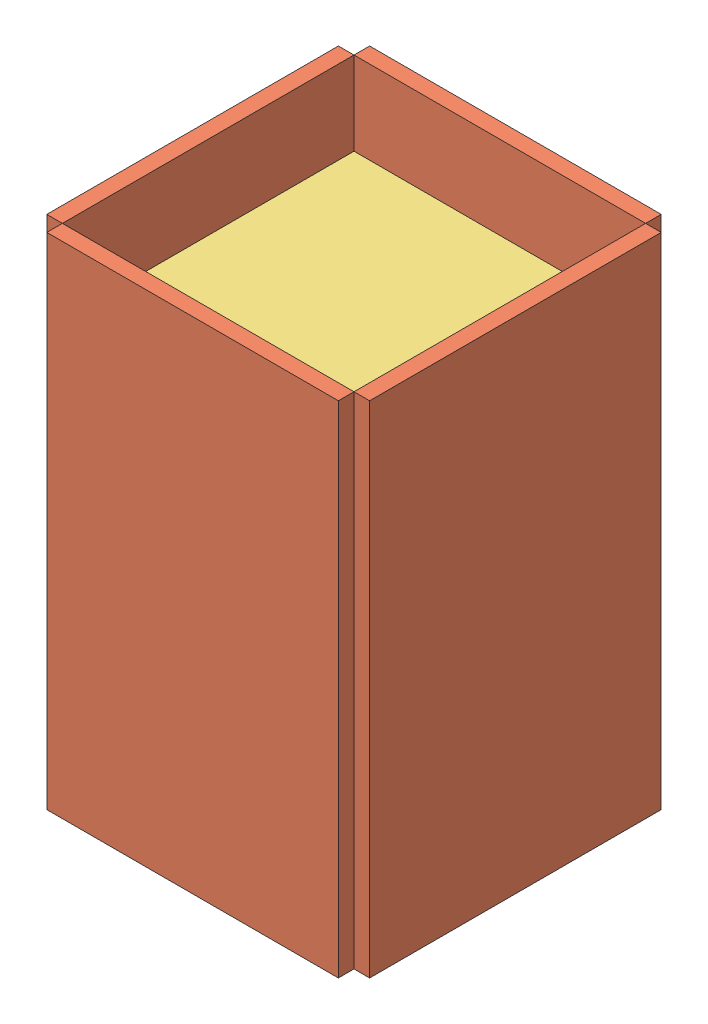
SolidWorks assembly 6 inch Building.SLDASM, configuration Default (file format 9000). Lengths in mm.
Overall size (98.43 152.4 98.43).
6 component instances, 3 part files, 16 mates.
Components (placement in the parent):
- 3.5 in 2x4 wood-1: 3.5 in 2x4 wood.SLDPRT [Default] at (27.6558 0 68.2405) size (88.9 38.1 88.9)
- 3.5 in x 6 in Corrugated Plastic-1: 3.5 in x 6 in Corrugated Plastic.SLDPRT [Default] at (-15.5691 0 112.6905) x (1 0 0) z (0 -1 0) size (88.9 4.76 152.4)
- 3.5 in x 6 in Corrugated Plastic-2: 3.5 in x 6 in Corrugated Plastic.SLDPRT [Default] at (78.0934 0 23.7905) x (0 0 1) z (0 -1 0) size (88.9 4.76 152.4)
- 3.5 in x 6 in Corrugated Plastic-3: 3.5 in x 6 in Corrugated Plastic.SLDPRT [Default] at (-15.5691 0 23.7905) x (0 0 1) z (0 -1 0) size (88.9 4.76 152.4)
- 3.5 in x 6 in Corrugated Plastic-4: 3.5 in x 6 in Corrugated Plastic.SLDPRT [Default] at (-15.5691 0 19.028) x (1 0 0) z (0 -1 0) size (88.9 4.76 152.4)
- 3.5 in x 3.5 in Corrugated Plastic-1: 3.5 in x 3.5 in Corrugated Plastic.SLDPRT [Default] at (-15.5691 122.2375 112.6905) size (88.9 4.76 88.9)
Mates (geometry in assembly coordinates):
- Coincident1: coincident anti-aligned: plane of 3.5 in 2x4 wood-1 through (27.6558 0 68.2405) normal (0 -1 0); plane of assembly through (0 0 0) normal (0 1 0)
- Coincident2: coincident anti-aligned: plane of 3.5 in 2x4 wood-1 through (-15.5691 38.1 112.6905) normal (0 0 1); plane of 3.5 in x 6 in Corrugated Plastic-1 through (-15.5691 0 112.6905) normal (0 0 -1)
- Coincident3: coincident aligned: plane of 3.5 in 2x4 wood-1 through (27.6558 0 68.2405) normal (0 -1 0); plane of 3.5 in x 6 in Corrugated Plastic-1 through (-15.5691 0 117.453) normal (0 -1 0)
- Coincident4: coincident aligned: plane of 3.5 in 2x4 wood-1 through (73.3309 38.1 23.7905) normal (1 0 0); plane of 3.5 in x 6 in Corrugated Plastic-1 through (73.3309 0 117.453) normal (1 0 0)
- Coincident5: coincident anti-aligned: plane of 3.5 in 2x4 wood-1 through (73.3309 38.1 23.7905) normal (1 0 0); plane of 3.5 in x 6 in Corrugated Plastic-2 through (73.3309 0 23.7905) normal (-1 0 0)
- Coincident6: coincident aligned: plane of 3.5 in 2x4 wood-1 through (27.6558 0 68.2405) normal (0 -1 0); plane of 3.5 in x 6 in Corrugated Plastic-2 through (73.3309 0 23.7905) normal (0 -1 0)
- Coincident7: coincident aligned: line of 3.5 in x 6 in Corrugated Plastic-1 through (73.3309 0 112.6905) axis (0 1 0); line of 3.5 in x 6 in Corrugated Plastic-2 through (73.3309 0 112.6905) axis (0 1 0)
- Coincident8: coincident anti-aligned: plane of 3.5 in 2x4 wood-1 through (-15.5691 38.1 23.7905) normal (0 0 -1); plane of 3.5 in x 6 in Corrugated Plastic-4 through (-15.5691 0 23.7905) normal (0 0 1)
- Coincident9: coincident anti-aligned: plane of 3.5 in 2x4 wood-1 through (-15.5691 38.1 23.7905) normal (-1 0 0); plane of 3.5 in x 6 in Corrugated Plastic-3 through (-15.5691 0 23.7905) normal (1 0 0)
- Coincident10: coincident anti-aligned: line of 3.5 in x 6 in Corrugated Plastic-1 through (-15.5691 152.4 112.6905) axis (0 -1 0); line of 3.5 in x 6 in Corrugated Plastic-3 through (-15.5691 0 112.6905) axis (0 1 0)
- Coincident11: coincident: line of 3.5 in x 6 in Corrugated Plastic-2 through (73.3309 152.4 23.7905) axis (0 -1 0); plane of 3.5 in x 6 in Corrugated Plastic-4 through (73.3309 0 23.7905) normal (1 0 0)
- Coincident12: coincident aligned: plane of 3.5 in 2x4 wood-1 through (27.6558 0 68.2405) normal (0 -1 0); plane of 3.5 in x 6 in Corrugated Plastic-4 through (-15.5691 0 23.7905) normal (0 -1 0)
- Coincident13: coincident aligned: plane of 3.5 in 2x4 wood-1 through (27.6558 0 68.2405) normal (0 -1 0); plane of 3.5 in x 6 in Corrugated Plastic-3 through (-20.3316 0 23.7905) normal (0 -1 0)
- Coincident14: coincident anti-aligned: plane of 3.5 in x 6 in Corrugated Plastic-3 through (-15.5691 0 23.7905) normal (1 0 0); plane of 3.5 in x 3.5 in Corrugated Plastic-1 through (-15.5691 127 112.6905) normal (-1 0 0)
- Coincident15: coincident anti-aligned: plane of 3.5 in x 6 in Corrugated Plastic-1 through (-15.5691 0 112.6905) normal (0 0 -1); plane of 3.5 in x 3.5 in Corrugated Plastic-1 through (-15.5691 127 112.6905) normal (0 0 1)
- Distance1: distance = 25.4 mm aligned: plane of 3.5 in x 3.5 in Corrugated Plastic-1 through (-15.5691 127 112.6905) normal (0 1 0); plane of 3.5 in x 6 in Corrugated Plastic-4 through (-15.5691 152.4 23.7905) normal (0 1 0)
